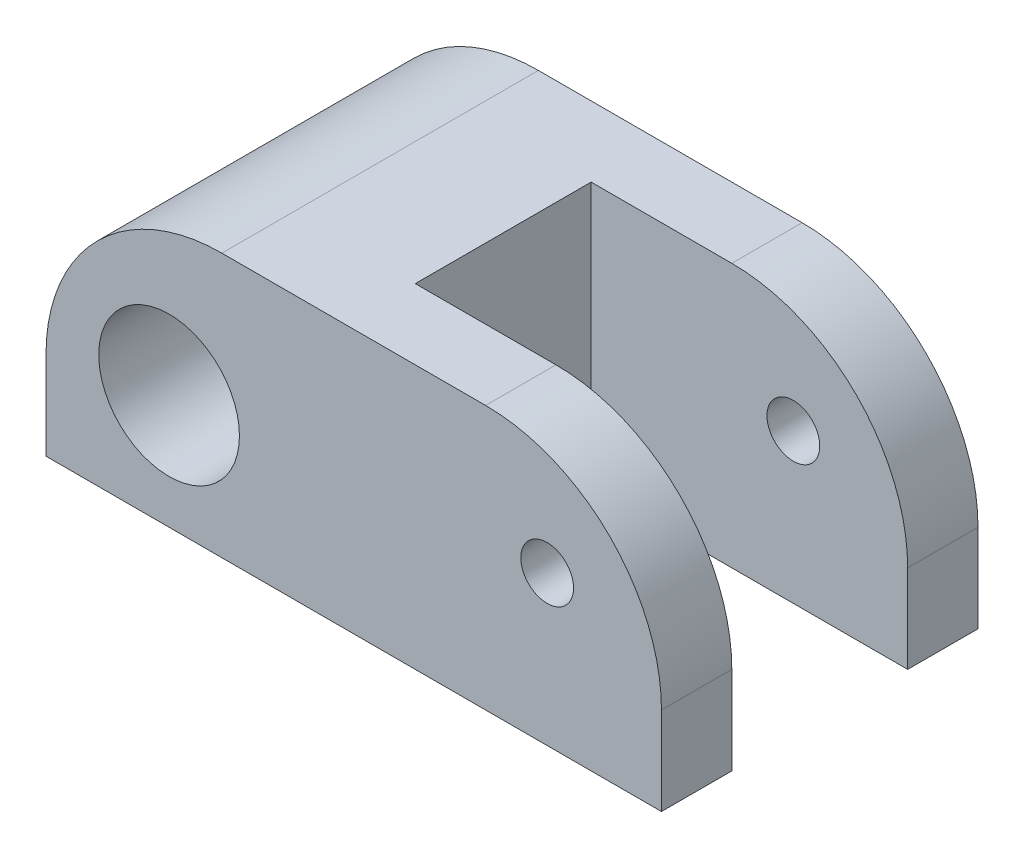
ISO-10303-21;
HEADER;
FILE_DESCRIPTION(('STEP AP214'),'2;1');
FILE_NAME('part.step','',(''),(''),'','','');
FILE_SCHEMA(('AUTOMOTIVE_DESIGN { 1 0 10303 214 1 1 1 1 }'));
ENDSEC;
DATA;
#1=APPLICATION_CONTEXT('core data for automotive mechanical design processes');
#2=APPLICATION_PROTOCOL_DEFINITION('international standard','automotive_design',2000,#1);
#3=PRODUCT_CONTEXT('',#1,'mechanical');
#4=PRODUCT('Part','Part','',(#3));
#5=PRODUCT_RELATED_PRODUCT_CATEGORY('part','',(#4));
#6=PRODUCT_DEFINITION_FORMATION('','',#4);
#7=PRODUCT_DEFINITION_CONTEXT('part definition',#1,'design');
#8=PRODUCT_DEFINITION('design','',#6,#7);
#9=PRODUCT_DEFINITION_SHAPE('','',#8);
#10=(LENGTH_UNIT() NAMED_UNIT(*) SI_UNIT(.MILLI.,.METRE.));
#11=(NAMED_UNIT(*) PLANE_ANGLE_UNIT() SI_UNIT($,.RADIAN.));
#12=(NAMED_UNIT(*) SI_UNIT($,.STERADIAN.) SOLID_ANGLE_UNIT());
#13=UNCERTAINTY_MEASURE_WITH_UNIT(LENGTH_MEASURE(1.E-05),#10,'distance_accuracy_value','');
#14=(GEOMETRIC_REPRESENTATION_CONTEXT(3) GLOBAL_UNCERTAINTY_ASSIGNED_CONTEXT((#13)) GLOBAL_UNIT_ASSIGNED_CONTEXT((#10,
#11,#12)) REPRESENTATION_CONTEXT('',''));
#15=CARTESIAN_POINT('',(0.,0.,0.));
#16=DIRECTION('',(0.,0.,1.));
#17=DIRECTION('',(1.,0.,0.));
#18=AXIS2_PLACEMENT_3D('',#15,#16,#17);
#19=CARTESIAN_POINT('',(35.,0.,9.));
#20=DIRECTION('',(-1.,0.,0.));
#21=DIRECTION('',(0.,0.,1.));
#22=AXIS2_PLACEMENT_3D('',#19,#20,#21);
#23=PLANE('',#22);
#24=DIRECTION('',(0.,0.,-1.));
#25=VECTOR('',#24,1.);
#26=CARTESIAN_POINT('',(35.,5.,9.));
#27=LINE('',#26,#25);
#28=CARTESIAN_POINT('',(35.,5.,-9.));
#29=VERTEX_POINT('',#28);
#30=CARTESIAN_POINT('',(35.,5.,-5.));
#31=VERTEX_POINT('',#30);
#32=EDGE_CURVE('E221',#29,#31,#27,.F.);
#33=ORIENTED_EDGE('',*,*,#32,.T.);
#34=DIRECTION('',(0.,1.,0.));
#35=VECTOR('',#34,1.);
#36=CARTESIAN_POINT('',(35.,-3.,-5.));
#37=LINE('',#36,#35);
#38=CARTESIAN_POINT('',(35.,0.,-5.));
#39=VERTEX_POINT('',#38);
#40=EDGE_CURVE('E155',#39,#31,#37,.T.);
#41=ORIENTED_EDGE('',*,*,#40,.F.);
#42=DIRECTION('',(0.,0.,-1.));
#43=VECTOR('',#42,1.);
#44=CARTESIAN_POINT('',(35.,0.,9.));
#45=LINE('',#44,#43);
#46=CARTESIAN_POINT('',(35.,0.,-9.));
#47=VERTEX_POINT('',#46);
#48=EDGE_CURVE('E191',#39,#47,#45,.T.);
#49=ORIENTED_EDGE('',*,*,#48,.T.);
#50=DIRECTION('',(0.,1.,0.));
#51=VECTOR('',#50,1.);
#52=CARTESIAN_POINT('',(35.,0.,-9.));
#53=LINE('',#52,#51);
#54=EDGE_CURVE('E196',#47,#29,#53,.T.);
#55=ORIENTED_EDGE('',*,*,#54,.T.);
#56=EDGE_LOOP('',(#33,#41,#49,#55));
#57=FACE_BOUND('',#56,.T.);
#58=ADVANCED_FACE('F44',(#57),#23,.F.);
#59=CARTESIAN_POINT('',(28.5,8.5,9.));
#60=DIRECTION('',(0.,0.,-1.));
#61=DIRECTION('',(-1.,0.,0.));
#62=AXIS2_PLACEMENT_3D('',#59,#60,#61);
#63=CYLINDRICAL_SURFACE('',#62,1.5);
#64=CARTESIAN_POINT('',(28.5,8.5,-5.));
#65=DIRECTION('',(0.,0.,-1.));
#66=DIRECTION('',(-1.,0.,0.));
#67=AXIS2_PLACEMENT_3D('',#64,#65,#66);
#68=CIRCLE('',#67,1.5);
#69=CARTESIAN_POINT('',(27.,8.5,-5.));
#70=VERTEX_POINT('',#69);
#71=EDGE_CURVE('E161',#70,#70,#68,.T.);
#72=ORIENTED_EDGE('',*,*,#71,.F.);
#73=EDGE_LOOP('',(#72));
#74=FACE_BOUND('',#73,.T.);
#75=CARTESIAN_POINT('',(28.5,8.5,-9.));
#76=DIRECTION('',(0.,0.,1.));
#77=DIRECTION('',(1.,0.,0.));
#78=AXIS2_PLACEMENT_3D('',#75,#76,#77);
#79=CIRCLE('',#78,1.5);
#80=CARTESIAN_POINT('',(30.,8.5,-9.));
#81=VERTEX_POINT('',#80);
#82=EDGE_CURVE('E169',#81,#81,#79,.T.);
#83=ORIENTED_EDGE('',*,*,#82,.F.);
#84=EDGE_LOOP('',(#83));
#85=FACE_BOUND('',#84,.T.);
#86=ADVANCED_FACE('F263',(#74,#85),#63,.F.);
#87=CARTESIAN_POINT('',(25.,5.,9.));
#88=DIRECTION('',(0.,0.,-1.));
#89=DIRECTION('',(-1.,0.,0.));
#90=AXIS2_PLACEMENT_3D('',#87,#88,#89);
#91=CYLINDRICAL_SURFACE('',#90,10.);
#92=CARTESIAN_POINT('',(25.,5.,-5.));
#93=DIRECTION('',(0.,0.,-1.));
#94=DIRECTION('',(-1.,0.,0.));
#95=AXIS2_PLACEMENT_3D('',#92,#93,#94);
#96=CIRCLE('',#95,10.);
#97=CARTESIAN_POINT('',(25.,15.,-5.));
#98=VERTEX_POINT('',#97);
#99=EDGE_CURVE('E13',#31,#98,#96,.F.);
#100=ORIENTED_EDGE('',*,*,#99,.F.);
#101=ORIENTED_EDGE('',*,*,#32,.F.);
#102=CARTESIAN_POINT('',(25.,5.,-9.));
#103=DIRECTION('',(0.,0.,-1.));
#104=DIRECTION('',(-1.,0.,0.));
#105=AXIS2_PLACEMENT_3D('',#102,#103,#104);
#106=CIRCLE('',#105,10.);
#107=CARTESIAN_POINT('',(25.,15.,-9.));
#108=VERTEX_POINT('',#107);
#109=EDGE_CURVE('E219',#108,#29,#106,.T.);
#110=ORIENTED_EDGE('',*,*,#109,.F.);
#111=DIRECTION('',(0.,0.,-1.));
#112=VECTOR('',#111,1.);
#113=CARTESIAN_POINT('',(25.,15.,9.));
#114=LINE('',#113,#112);
#115=EDGE_CURVE('E217',#98,#108,#114,.T.);
#116=ORIENTED_EDGE('',*,*,#115,.F.);
#117=EDGE_LOOP('',(#100,#101,#110,#116));
#118=FACE_BOUND('',#117,.T.);
#119=ADVANCED_FACE('F256',(#118),#91,.T.);
#120=CARTESIAN_POINT('',(0.,0.,9.));
#121=DIRECTION('',(0.,0.,-1.));
#122=DIRECTION('',(-1.,0.,0.));
#123=AXIS2_PLACEMENT_3D('',#120,#121,#122);
#124=PLANE('',#123);
#125=DIRECTION('',(0.,1.,0.));
#126=VECTOR('',#125,1.);
#127=CARTESIAN_POINT('',(35.,0.,9.));
#128=LINE('',#127,#126);
#129=CARTESIAN_POINT('',(35.,0.,9.));
#130=VERTEX_POINT('',#129);
#131=CARTESIAN_POINT('',(35.,5.,9.));
#132=VERTEX_POINT('',#131);
#133=EDGE_CURVE('E187',#130,#132,#128,.T.);
#134=ORIENTED_EDGE('',*,*,#133,.T.);
#135=CARTESIAN_POINT('',(25.,5.,9.));
#136=DIRECTION('',(0.,0.,-1.));
#137=DIRECTION('',(-1.,0.,0.));
#138=AXIS2_PLACEMENT_3D('',#135,#136,#137);
#139=CIRCLE('',#138,10.);
#140=CARTESIAN_POINT('',(25.,15.,9.));
#141=VERTEX_POINT('',#140);
#142=EDGE_CURVE('E224',#132,#141,#139,.F.);
#143=ORIENTED_EDGE('',*,*,#142,.T.);
#144=DIRECTION('',(-1.,0.,0.));
#145=VECTOR('',#144,1.);
#146=CARTESIAN_POINT('',(0.,15.,9.));
#147=LINE('',#146,#145);
#148=CARTESIAN_POINT('',(10.,15.,9.));
#149=VERTEX_POINT('',#148);
#150=EDGE_CURVE('E189',#141,#149,#147,.T.);
#151=ORIENTED_EDGE('',*,*,#150,.T.);
#152=CARTESIAN_POINT('',(10.,5.,9.));
#153=DIRECTION('',(0.,0.,-1.));
#154=DIRECTION('',(-1.,0.,0.));
#155=AXIS2_PLACEMENT_3D('',#152,#153,#154);
#156=CIRCLE('',#155,10.);
#157=CARTESIAN_POINT('',(0.,5.,9.));
#158=VERTEX_POINT('',#157);
#159=EDGE_CURVE('E215',#149,#158,#156,.F.);
#160=ORIENTED_EDGE('',*,*,#159,.T.);
#161=DIRECTION('',(0.,-1.,0.));
#162=VECTOR('',#161,1.);
#163=CARTESIAN_POINT('',(0.,0.,9.));
#164=LINE('',#163,#162);
#165=CARTESIAN_POINT('',(0.,0.,9.));
#166=VERTEX_POINT('',#165);
#167=EDGE_CURVE('E182',#158,#166,#164,.T.);
#168=ORIENTED_EDGE('',*,*,#167,.T.);
#169=DIRECTION('',(1.,0.,0.));
#170=VECTOR('',#169,1.);
#171=CARTESIAN_POINT('',(0.,0.,9.));
#172=LINE('',#171,#170);
#173=EDGE_CURVE('E184',#166,#130,#172,.T.);
#174=ORIENTED_EDGE('',*,*,#173,.T.);
#175=EDGE_LOOP('',(#134,#143,#151,#160,#168,#174));
#176=FACE_BOUND('',#175,.T.);
#177=CARTESIAN_POINT('',(7.,6.5,9.));
#178=DIRECTION('',(0.,0.,1.));
#179=DIRECTION('',(1.,0.,0.));
#180=AXIS2_PLACEMENT_3D('',#177,#178,#179);
#181=CIRCLE('',#180,4.);
#182=CARTESIAN_POINT('',(11.,6.5,9.));
#183=VERTEX_POINT('',#182);
#184=EDGE_CURVE('E176',#183,#183,#181,.T.);
#185=ORIENTED_EDGE('',*,*,#184,.F.);
#186=EDGE_LOOP('',(#185));
#187=FACE_BOUND('',#186,.T.);
#188=CARTESIAN_POINT('',(28.5,8.5,9.));
#189=DIRECTION('',(0.,0.,1.));
#190=DIRECTION('',(1.,0.,0.));
#191=AXIS2_PLACEMENT_3D('',#188,#189,#190);
#192=CIRCLE('',#191,1.5);
#193=CARTESIAN_POINT('',(30.,8.5,9.));
#194=VERTEX_POINT('',#193);
#195=EDGE_CURVE('E170',#194,#194,#192,.T.);
#196=ORIENTED_EDGE('',*,*,#195,.F.);
#197=EDGE_LOOP('',(#196));
#198=FACE_BOUND('',#197,.T.);
#199=ADVANCED_FACE('F230',(#176,#187,#198),#124,.F.);
#200=CARTESIAN_POINT('',(0.,0.,-9.));
#201=DIRECTION('',(0.,0.,-1.));
#202=DIRECTION('',(-1.,0.,0.));
#203=AXIS2_PLACEMENT_3D('',#200,#201,#202);
#204=PLANE('',#203);
#205=CARTESIAN_POINT('',(7.,6.5,-9.));
#206=DIRECTION('',(0.,0.,1.));
#207=DIRECTION('',(1.,0.,0.));
#208=AXIS2_PLACEMENT_3D('',#205,#206,#207);
#209=CIRCLE('',#208,4.);
#210=CARTESIAN_POINT('',(11.,6.5,-9.));
#211=VERTEX_POINT('',#210);
#212=EDGE_CURVE('E173',#211,#211,#209,.T.);
#213=ORIENTED_EDGE('',*,*,#212,.T.);
#214=EDGE_LOOP('',(#213));
#215=FACE_BOUND('',#214,.T.);
#216=DIRECTION('',(-1.,0.,0.));
#217=VECTOR('',#216,1.);
#218=CARTESIAN_POINT('',(0.,15.,-9.));
#219=LINE('',#218,#217);
#220=CARTESIAN_POINT('',(10.,15.,-9.));
#221=VERTEX_POINT('',#220);
#222=EDGE_CURVE('E185',#108,#221,#219,.T.);
#223=ORIENTED_EDGE('',*,*,#222,.F.);
#224=ORIENTED_EDGE('',*,*,#109,.T.);
#225=ORIENTED_EDGE('',*,*,#54,.F.);
#226=DIRECTION('',(1.,0.,0.));
#227=VECTOR('',#226,1.);
#228=CARTESIAN_POINT('',(0.,0.,-9.));
#229=LINE('',#228,#227);
#230=CARTESIAN_POINT('',(0.,0.,-9.));
#231=VERTEX_POINT('',#230);
#232=EDGE_CURVE('E193',#231,#47,#229,.T.);
#233=ORIENTED_EDGE('',*,*,#232,.F.);
#234=DIRECTION('',(0.,-1.,0.));
#235=VECTOR('',#234,1.);
#236=CARTESIAN_POINT('',(0.,0.,-9.));
#237=LINE('',#236,#235);
#238=CARTESIAN_POINT('',(0.,5.,-9.));
#239=VERTEX_POINT('',#238);
#240=EDGE_CURVE('E179',#239,#231,#237,.T.);
#241=ORIENTED_EDGE('',*,*,#240,.F.);
#242=CARTESIAN_POINT('',(10.,5.,-9.));
#243=DIRECTION('',(0.,0.,-1.));
#244=DIRECTION('',(-1.,0.,0.));
#245=AXIS2_PLACEMENT_3D('',#242,#243,#244);
#246=CIRCLE('',#245,10.);
#247=EDGE_CURVE('E209',#239,#221,#246,.T.);
#248=ORIENTED_EDGE('',*,*,#247,.T.);
#249=EDGE_LOOP('',(#223,#224,#225,#233,#241,#248));
#250=FACE_BOUND('',#249,.T.);
#251=ORIENTED_EDGE('',*,*,#82,.T.);
#252=EDGE_LOOP('',(#251));
#253=FACE_BOUND('',#252,.T.);
#254=ADVANCED_FACE('F259',(#215,#250,#253),#204,.T.);
#255=CARTESIAN_POINT('',(0.,0.,9.));
#256=DIRECTION('',(1.,0.,0.));
#257=DIRECTION('',(0.,0.,-1.));
#258=AXIS2_PLACEMENT_3D('',#255,#256,#257);
#259=PLANE('',#258);
#260=ORIENTED_EDGE('',*,*,#167,.F.);
#261=DIRECTION('',(0.,0.,-1.));
#262=VECTOR('',#261,1.);
#263=CARTESIAN_POINT('',(0.,5.,9.));
#264=LINE('',#263,#262);
#265=EDGE_CURVE('E206',#158,#239,#264,.T.);
#266=ORIENTED_EDGE('',*,*,#265,.T.);
#267=ORIENTED_EDGE('',*,*,#240,.T.);
#268=DIRECTION('',(0.,0.,-1.));
#269=VECTOR('',#268,1.);
#270=CARTESIAN_POINT('',(0.,0.,9.));
#271=LINE('',#270,#269);
#272=EDGE_CURVE('E203',#166,#231,#271,.T.);
#273=ORIENTED_EDGE('',*,*,#272,.F.);
#274=EDGE_LOOP('',(#260,#266,#267,#273));
#275=FACE_BOUND('',#274,.T.);
#276=ADVANCED_FACE('F242',(#275),#259,.F.);
#277=CARTESIAN_POINT('',(0.,0.,9.));
#278=DIRECTION('',(0.,1.,0.));
#279=DIRECTION('',(0.,0.,1.));
#280=AXIS2_PLACEMENT_3D('',#277,#278,#279);
#281=PLANE('',#280);
#282=ORIENTED_EDGE('',*,*,#48,.F.);
#283=DIRECTION('',(-1.,0.,0.));
#284=VECTOR('',#283,1.);
#285=CARTESIAN_POINT('',(0.,0.,-5.));
#286=LINE('',#285,#284);
#287=CARTESIAN_POINT('',(17.,0.,-5.));
#288=VERTEX_POINT('',#287);
#289=EDGE_CURVE('E164',#39,#288,#286,.T.);
#290=ORIENTED_EDGE('',*,*,#289,.T.);
#291=DIRECTION('',(0.,0.,1.));
#292=VECTOR('',#291,1.);
#293=CARTESIAN_POINT('',(17.,0.,9.));
#294=LINE('',#293,#292);
#295=CARTESIAN_POINT('',(17.,0.,5.));
#296=VERTEX_POINT('',#295);
#297=EDGE_CURVE('E167',#288,#296,#294,.T.);
#298=ORIENTED_EDGE('',*,*,#297,.T.);
#299=DIRECTION('',(1.,0.,0.));
#300=VECTOR('',#299,1.);
#301=CARTESIAN_POINT('',(0.,0.,5.));
#302=LINE('',#301,#300);
#303=CARTESIAN_POINT('',(35.,0.,5.));
#304=VERTEX_POINT('',#303);
#305=EDGE_CURVE('E130',#296,#304,#302,.T.);
#306=ORIENTED_EDGE('',*,*,#305,.T.);
#307=EDGE_CURVE('E200',#130,#304,#45,.T.);
#308=ORIENTED_EDGE('',*,*,#307,.F.);
#309=ORIENTED_EDGE('',*,*,#173,.F.);
#310=ORIENTED_EDGE('',*,*,#272,.T.);
#311=ORIENTED_EDGE('',*,*,#232,.T.);
#312=EDGE_LOOP('',(#282,#290,#298,#306,#308,#309,#310,#311));
#313=FACE_BOUND('',#312,.T.);
#314=ADVANCED_FACE('F247',(#313),#281,.F.);
#315=ORIENTED_EDGE('',*,*,#307,.T.);
#316=DIRECTION('',(0.,1.,0.));
#317=VECTOR('',#316,1.);
#318=CARTESIAN_POINT('',(35.,-3.,5.));
#319=LINE('',#318,#317);
#320=CARTESIAN_POINT('',(35.,5.,5.));
#321=VERTEX_POINT('',#320);
#322=EDGE_CURVE('E133',#304,#321,#319,.T.);
#323=ORIENTED_EDGE('',*,*,#322,.T.);
#324=EDGE_CURVE('E67',#321,#132,#27,.F.);
#325=ORIENTED_EDGE('',*,*,#324,.T.);
#326=ORIENTED_EDGE('',*,*,#133,.F.);
#327=EDGE_LOOP('',(#315,#323,#325,#326));
#328=FACE_BOUND('',#327,.T.);
#329=ADVANCED_FACE('F226',(#328),#23,.F.);
#330=CARTESIAN_POINT('',(0.,15.,9.));
#331=DIRECTION('',(0.,-1.,0.));
#332=DIRECTION('',(1.,0.,0.));
#333=AXIS2_PLACEMENT_3D('',#330,#331,#332);
#334=PLANE('',#333);
#335=DIRECTION('',(0.,0.,1.));
#336=VECTOR('',#335,1.);
#337=CARTESIAN_POINT('',(17.,15.,-5.));
#338=LINE('',#337,#336);
#339=CARTESIAN_POINT('',(17.,15.,-5.));
#340=VERTEX_POINT('',#339);
#341=CARTESIAN_POINT('',(17.,15.,5.));
#342=VERTEX_POINT('',#341);
#343=EDGE_CURVE('E137',#340,#342,#338,.T.);
#344=ORIENTED_EDGE('',*,*,#343,.F.);
#345=DIRECTION('',(-1.,0.,0.));
#346=VECTOR('',#345,1.);
#347=CARTESIAN_POINT('',(17.,15.,-5.));
#348=LINE('',#347,#346);
#349=EDGE_CURVE('E134',#98,#340,#348,.T.);
#350=ORIENTED_EDGE('',*,*,#349,.F.);
#351=ORIENTED_EDGE('',*,*,#115,.T.);
#352=ORIENTED_EDGE('',*,*,#222,.T.);
#353=DIRECTION('',(0.,0.,-1.));
#354=VECTOR('',#353,1.);
#355=CARTESIAN_POINT('',(10.,15.,9.));
#356=LINE('',#355,#354);
#357=EDGE_CURVE('E212',#221,#149,#356,.F.);
#358=ORIENTED_EDGE('',*,*,#357,.T.);
#359=ORIENTED_EDGE('',*,*,#150,.F.);
#360=CARTESIAN_POINT('',(25.,15.,5.));
#361=VERTEX_POINT('',#360);
#362=EDGE_CURVE('E149',#141,#361,#114,.T.);
#363=ORIENTED_EDGE('',*,*,#362,.T.);
#364=DIRECTION('',(1.,0.,0.));
#365=VECTOR('',#364,1.);
#366=CARTESIAN_POINT('',(17.,15.,5.));
#367=LINE('',#366,#365);
#368=EDGE_CURVE('E59',#342,#361,#367,.T.);
#369=ORIENTED_EDGE('',*,*,#368,.F.);
#370=EDGE_LOOP('',(#344,#350,#351,#352,#358,#359,#363,#369));
#371=FACE_BOUND('',#370,.T.);
#372=ADVANCED_FACE('F146',(#371),#334,.F.);
#373=CARTESIAN_POINT('',(7.,6.5,9.));
#374=DIRECTION('',(0.,0.,-1.));
#375=DIRECTION('',(-1.,0.,0.));
#376=AXIS2_PLACEMENT_3D('',#373,#374,#375);
#377=CYLINDRICAL_SURFACE('',#376,4.);
#378=ORIENTED_EDGE('',*,*,#184,.T.);
#379=EDGE_LOOP('',(#378));
#380=FACE_BOUND('',#379,.T.);
#381=ORIENTED_EDGE('',*,*,#212,.F.);
#382=EDGE_LOOP('',(#381));
#383=FACE_BOUND('',#382,.T.);
#384=ADVANCED_FACE('F278',(#380,#383),#377,.F.);
#385=CARTESIAN_POINT('',(28.5,8.5,5.));
#386=DIRECTION('',(0.,0.,1.));
#387=DIRECTION('',(1.,0.,0.));
#388=AXIS2_PLACEMENT_3D('',#385,#386,#387);
#389=CIRCLE('',#388,1.5);
#390=CARTESIAN_POINT('',(30.,8.5,5.));
#391=VERTEX_POINT('',#390);
#392=EDGE_CURVE('E154',#391,#391,#389,.T.);
#393=ORIENTED_EDGE('',*,*,#392,.F.);
#394=EDGE_LOOP('',(#393));
#395=FACE_BOUND('',#394,.T.);
#396=ORIENTED_EDGE('',*,*,#195,.T.);
#397=EDGE_LOOP('',(#396));
#398=FACE_BOUND('',#397,.T.);
#399=ADVANCED_FACE('F270',(#395,#398),#63,.F.);
#400=CARTESIAN_POINT('',(10.,5.,9.));
#401=DIRECTION('',(0.,0.,-1.));
#402=DIRECTION('',(-1.,0.,0.));
#403=AXIS2_PLACEMENT_3D('',#400,#401,#402);
#404=CYLINDRICAL_SURFACE('',#403,10.);
#405=ORIENTED_EDGE('',*,*,#159,.F.);
#406=ORIENTED_EDGE('',*,*,#357,.F.);
#407=ORIENTED_EDGE('',*,*,#247,.F.);
#408=ORIENTED_EDGE('',*,*,#265,.F.);
#409=EDGE_LOOP('',(#405,#406,#407,#408));
#410=FACE_BOUND('',#409,.T.);
#411=ADVANCED_FACE('F237',(#410),#404,.T.);
#412=CARTESIAN_POINT('',(25.,5.,5.));
#413=DIRECTION('',(0.,0.,1.));
#414=DIRECTION('',(1.,0.,0.));
#415=AXIS2_PLACEMENT_3D('',#412,#413,#414);
#416=CIRCLE('',#415,10.);
#417=EDGE_CURVE('E52',#361,#321,#416,.F.);
#418=ORIENTED_EDGE('',*,*,#417,.F.);
#419=ORIENTED_EDGE('',*,*,#362,.F.);
#420=ORIENTED_EDGE('',*,*,#142,.F.);
#421=ORIENTED_EDGE('',*,*,#324,.F.);
#422=EDGE_LOOP('',(#418,#419,#420,#421));
#423=FACE_BOUND('',#422,.T.);
#424=ADVANCED_FACE('F46',(#423),#91,.T.);
#425=CARTESIAN_POINT('',(17.,-3.,-5.));
#426=DIRECTION('',(-1.,0.,0.));
#427=DIRECTION('',(0.,-1.,0.));
#428=AXIS2_PLACEMENT_3D('',#425,#426,#427);
#429=PLANE('',#428);
#430=DIRECTION('',(0.,1.,0.));
#431=VECTOR('',#430,1.);
#432=CARTESIAN_POINT('',(17.,-3.,-5.));
#433=LINE('',#432,#431);
#434=EDGE_CURVE('E140',#288,#340,#433,.T.);
#435=ORIENTED_EDGE('',*,*,#434,.T.);
#436=ORIENTED_EDGE('',*,*,#343,.T.);
#437=DIRECTION('',(0.,1.,0.));
#438=VECTOR('',#437,1.);
#439=CARTESIAN_POINT('',(17.,-3.,5.));
#440=LINE('',#439,#438);
#441=EDGE_CURVE('E126',#296,#342,#440,.T.);
#442=ORIENTED_EDGE('',*,*,#441,.F.);
#443=ORIENTED_EDGE('',*,*,#297,.F.);
#444=EDGE_LOOP('',(#435,#436,#442,#443));
#445=FACE_BOUND('',#444,.T.);
#446=ADVANCED_FACE('F138',(#445),#429,.F.);
#447=CARTESIAN_POINT('',(17.,-3.,-5.));
#448=DIRECTION('',(0.,0.,-1.));
#449=DIRECTION('',(-1.,0.,0.));
#450=AXIS2_PLACEMENT_3D('',#447,#448,#449);
#451=PLANE('',#450);
#452=ORIENTED_EDGE('',*,*,#71,.T.);
#453=EDGE_LOOP('',(#452));
#454=FACE_BOUND('',#453,.T.);
#455=ORIENTED_EDGE('',*,*,#40,.T.);
#456=ORIENTED_EDGE('',*,*,#99,.T.);
#457=ORIENTED_EDGE('',*,*,#349,.T.);
#458=ORIENTED_EDGE('',*,*,#434,.F.);
#459=ORIENTED_EDGE('',*,*,#289,.F.);
#460=EDGE_LOOP('',(#455,#456,#457,#458,#459));
#461=FACE_BOUND('',#460,.T.);
#462=ADVANCED_FACE('F250',(#454,#461),#451,.F.);
#463=CARTESIAN_POINT('',(17.,-3.,5.));
#464=DIRECTION('',(0.,0.,1.));
#465=DIRECTION('',(1.,0.,0.));
#466=AXIS2_PLACEMENT_3D('',#463,#464,#465);
#467=PLANE('',#466);
#468=ORIENTED_EDGE('',*,*,#392,.T.);
#469=EDGE_LOOP('',(#468));
#470=FACE_BOUND('',#469,.T.);
#471=ORIENTED_EDGE('',*,*,#441,.T.);
#472=ORIENTED_EDGE('',*,*,#368,.T.);
#473=ORIENTED_EDGE('',*,*,#417,.T.);
#474=ORIENTED_EDGE('',*,*,#322,.F.);
#475=ORIENTED_EDGE('',*,*,#305,.F.);
#476=EDGE_LOOP('',(#471,#472,#473,#474,#475));
#477=FACE_BOUND('',#476,.T.);
#478=ADVANCED_FACE('F128',(#470,#477),#467,.F.);
#479=CLOSED_SHELL('',(#58,#86,#119,#199,#254,#276,#314,#329,#372,#384,#399,#411,#424,#446,#462,#478));
#480=MANIFOLD_SOLID_BREP('B2',#479);
#481=ADVANCED_BREP_SHAPE_REPRESENTATION('',(#18,#480),#14);
#482=SHAPE_DEFINITION_REPRESENTATION(#9,#481);
ENDSEC;
END-ISO-10303-21;
